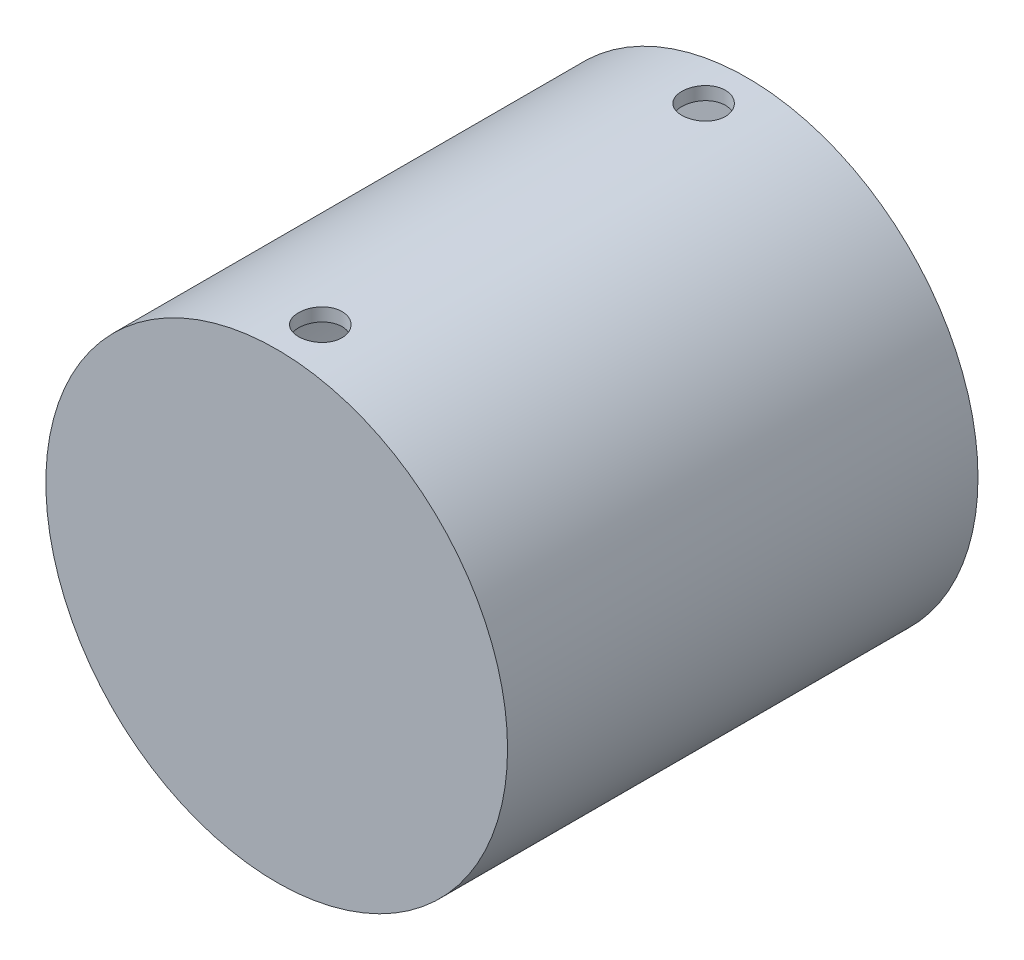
from build123d import *

# Parameters (mm, degrees)
SKETCH5_R           = 53
SKETCH5_R_2         = 50
BOSS_EXTRUDE5_DEPTH = 100
BOSS_EXTRUDE6_START = 4
SKETCH6_R           = 53
BOSS_EXTRUDE6_DEPTH = 4
SKETCH11_R          = 53
BOSS_EXTRUDE9_DEPTH = 4
SKETCH12_R          = 7.5
CUT_EXTRUDE4_DEPTH  = 18
SKETCH13_R          = 5
CUT_EXTRUDE5_DEPTH  = 92


with BuildPart() as part:
    # Sketch5 → Boss-Extrude5 (new body)
    with BuildSketch(Plane.XY):
        Circle(SKETCH5_R)
        Circle(SKETCH5_R_2, mode=Mode.SUBTRACT)
    extrude(amount=-BOSS_EXTRUDE5_DEPTH)

    # Sketch6 → Boss-Extrude6 (add)
    with BuildSketch(Plane.XY.offset(BOSS_EXTRUDE6_START)):
        Circle(SKETCH6_R)
    extrude(amount=-BOSS_EXTRUDE6_DEPTH)

    # Sketch11 → Boss-Extrude9 (add)
    with BuildSketch(Plane(origin=(0, 0, -100), x_dir=(-1, 0, 0), z_dir=(0, 0, -1))):
        with Locations(Location((0, 0, 0), (0, 0, 180))):
            Circle(SKETCH11_R)
    extrude(amount=BOSS_EXTRUDE9_DEPTH)

    # Sketch12 → Cut-Extrude4 (cut)
    with BuildSketch(Plane(origin=(0, 0, -100), x_dir=(-1, 0, 0), z_dir=(0, 0, -1))):
        Circle(SKETCH12_R)
    extrude(amount=CUT_EXTRUDE4_DEPTH, mode=Mode.SUBTRACT)

    # Sketch13 → Cut-Extrude5 (cut)
    with BuildSketch(Plane(origin=(0, 0, 0), x_dir=(1, 0, 0), z_dir=(0, 1, 0))):
        with Locations(Location((0, 94, 0), (0, 0, 90))):
            Circle(SKETCH13_R)
        with Locations(Location((0, 6, 0), (0, 0, 90))):
            Circle(SKETCH13_R)
    extrude(amount=CUT_EXTRUDE5_DEPTH, mode=Mode.SUBTRACT)


solid = part.part
